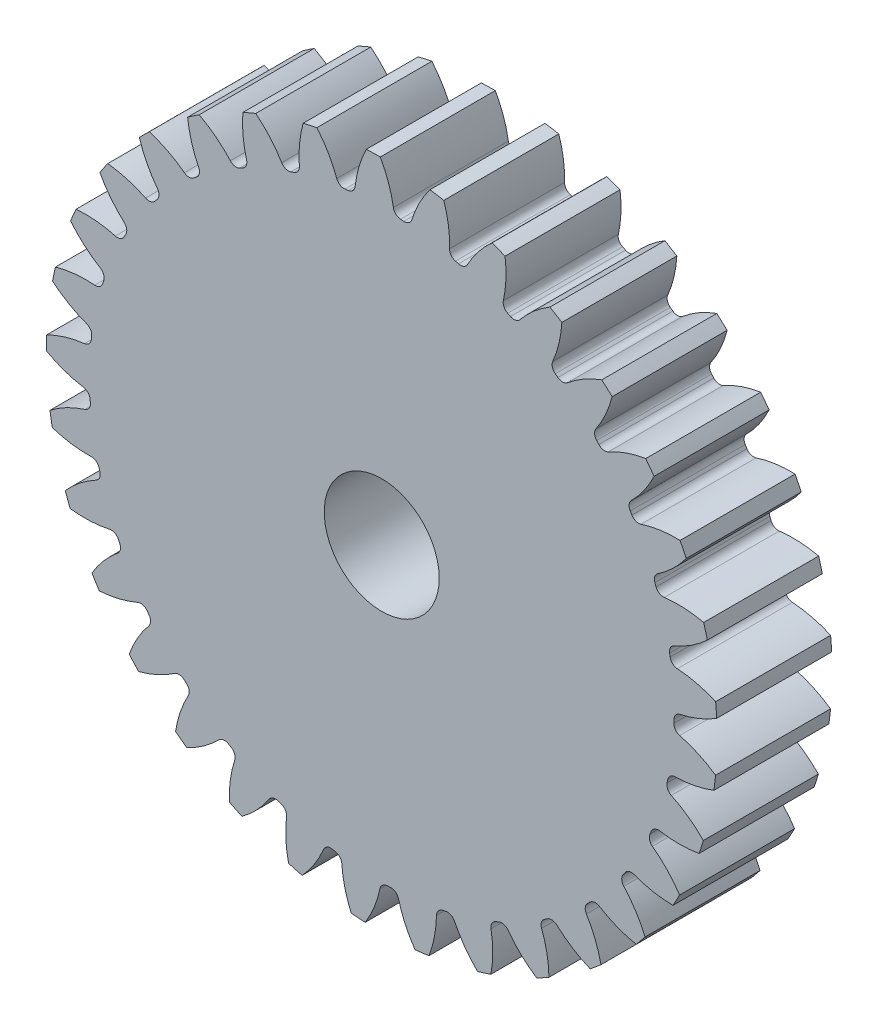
from build123d import *

# Parameters (mm, degrees)
SKETCH3_R         = 296.333333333
GEARBODY_DEPTH    = 101.6
TOOTHCUT_DEPTH    = 432.218562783
CIRPATTERN1_COUNT = 33
BOREDIA_R         = 50.8
BORE_DEPTH        = 12700


with BuildPart() as part:
    # Sketch3 → gearBody (new body)
    with BuildSketch(Plane.XY):
        Circle(SKETCH3_R)
    extrude(amount=GEARBODY_DEPTH)

    # Sketch2 → toothCut (cut, through all)
    with BuildSketch(Plane.XY):
        with BuildLine():
            ThreePointArc((258.13217039, -7.227520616), (258.168195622, -5.799759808), (258.196323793, -4.371821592))
            ThreePointArc((258.196323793, -4.371821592), (259.763890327, -0.111265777), (263.641275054, 2.24998143))
            ThreePointArc((263.641275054, 2.24998143), (280.5792391, 7.484379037), (296.333333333, 15.614696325))
            ThreePointArc((296.333333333, 15.614696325), (296.669588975, -6.664695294), (295.333162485, -28.906510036))
            ThreePointArc((295.333162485, -28.906510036), (279.960073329, -20.076919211), (263.274260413, -14.087161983))
            ThreePointArc((263.274260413, -14.087161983), (259.506824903, -11.554173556), (258.13217039, -7.227520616))
        make_face()
    toothcut = extrude(amount=TOOTHCUT_DEPTH, mode=Mode.SUBTRACT)

    # CirPattern1: toothCut ×33 about axis
    cirpattern1_axis = Axis((0, 0, 0), (0, 0, 1))
    for i in range(1, CIRPATTERN1_COUNT):
        add(toothcut.rotate(cirpattern1_axis, i * 360 / CIRPATTERN1_COUNT), mode=Mode.SUBTRACT)

    # boreDia → bore (cut, symmetric)
    with BuildSketch(Plane.XY):
        Circle(BOREDIA_R)
    extrude(amount=BORE_DEPTH, both=True, mode=Mode.SUBTRACT)


solid = part.part
